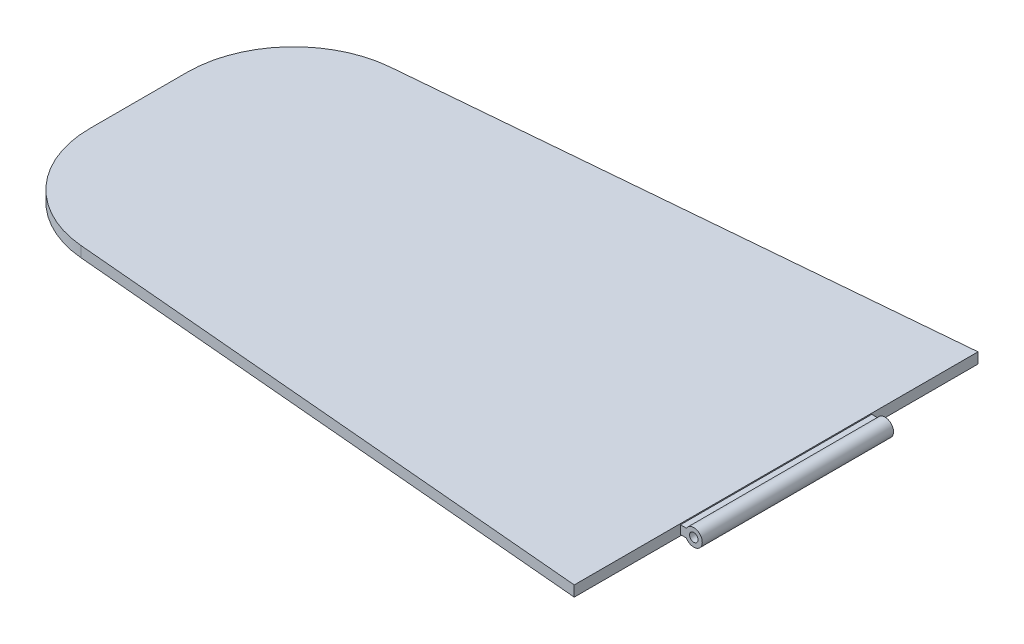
ISO-10303-21;
HEADER;
FILE_DESCRIPTION(('STEP AP214'),'2;1');
FILE_NAME('part.step','',(''),(''),'','','');
FILE_SCHEMA(('AUTOMOTIVE_DESIGN { 1 0 10303 214 1 1 1 1 }'));
ENDSEC;
DATA;
#1=APPLICATION_CONTEXT('core data for automotive mechanical design processes');
#2=APPLICATION_PROTOCOL_DEFINITION('international standard','automotive_design',2000,#1);
#3=PRODUCT_CONTEXT('',#1,'mechanical');
#4=PRODUCT('Part','Part','',(#3));
#5=PRODUCT_RELATED_PRODUCT_CATEGORY('part','',(#4));
#6=PRODUCT_DEFINITION_FORMATION('','',#4);
#7=PRODUCT_DEFINITION_CONTEXT('part definition',#1,'design');
#8=PRODUCT_DEFINITION('design','',#6,#7);
#9=PRODUCT_DEFINITION_SHAPE('','',#8);
#10=(LENGTH_UNIT() NAMED_UNIT(*) SI_UNIT(.MILLI.,.METRE.));
#11=(NAMED_UNIT(*) PLANE_ANGLE_UNIT() SI_UNIT($,.RADIAN.));
#12=(NAMED_UNIT(*) SI_UNIT($,.STERADIAN.) SOLID_ANGLE_UNIT());
#13=UNCERTAINTY_MEASURE_WITH_UNIT(LENGTH_MEASURE(1.E-05),#10,'distance_accuracy_value','');
#14=(GEOMETRIC_REPRESENTATION_CONTEXT(3) GLOBAL_UNCERTAINTY_ASSIGNED_CONTEXT((#13)) GLOBAL_UNIT_ASSIGNED_CONTEXT((#10,
#11,#12)) REPRESENTATION_CONTEXT('',''));
#15=CARTESIAN_POINT('',(0.,0.,0.));
#16=DIRECTION('',(0.,0.,1.));
#17=DIRECTION('',(1.,0.,0.));
#18=AXIS2_PLACEMENT_3D('',#15,#16,#17);
#19=CARTESIAN_POINT('',(0.,10.,-190.));
#20=DIRECTION('',(-1.,0.,0.));
#21=DIRECTION('',(0.,0.,1.));
#22=AXIS2_PLACEMENT_3D('',#19,#20,#21);
#23=PLANE('',#22);
#24=DIRECTION('',(0.,0.,-1.));
#25=VECTOR('',#24,1.);
#26=CARTESIAN_POINT('',(0.,0.,-190.));
#27=LINE('',#26,#25);
#28=CARTESIAN_POINT('',(0.,0.,190.));
#29=VERTEX_POINT('',#28);
#30=CARTESIAN_POINT('',(0.,0.,-190.));
#31=VERTEX_POINT('',#30);
#32=EDGE_CURVE('E153',#29,#31,#27,.T.);
#33=ORIENTED_EDGE('',*,*,#32,.T.);
#34=DIRECTION('',(0.,-1.,0.));
#35=VECTOR('',#34,1.);
#36=CARTESIAN_POINT('',(0.,10.,-190.));
#37=LINE('',#36,#35);
#38=CARTESIAN_POINT('',(0.,10.,-190.));
#39=VERTEX_POINT('',#38);
#40=EDGE_CURVE('E163',#39,#31,#37,.T.);
#41=ORIENTED_EDGE('',*,*,#40,.F.);
#42=DIRECTION('',(0.,0.,-1.));
#43=VECTOR('',#42,1.);
#44=CARTESIAN_POINT('',(0.,10.,-190.));
#45=LINE('',#44,#43);
#46=CARTESIAN_POINT('',(0.,10.,190.));
#47=VERTEX_POINT('',#46);
#48=EDGE_CURVE('E161',#47,#39,#45,.T.);
#49=ORIENTED_EDGE('',*,*,#48,.F.);
#50=DIRECTION('',(0.,-1.,0.));
#51=VECTOR('',#50,1.);
#52=CARTESIAN_POINT('',(0.,10.,190.));
#53=LINE('',#52,#51);
#54=EDGE_CURVE('E177',#47,#29,#53,.T.);
#55=ORIENTED_EDGE('',*,*,#54,.T.);
#56=EDGE_LOOP('',(#33,#41,#49,#55));
#57=FACE_BOUND('',#56,.T.);
#58=DIRECTION('',(0.,0.,-1.));
#59=VECTOR('',#58,1.);
#60=CARTESIAN_POINT('',(0.,0.999999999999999,90.));
#61=LINE('',#60,#59);
#62=CARTESIAN_POINT('',(0.,0.999999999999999,90.));
#63=VERTEX_POINT('',#62);
#64=CARTESIAN_POINT('',(0.,0.999999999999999,-90.));
#65=VERTEX_POINT('',#64);
#66=EDGE_CURVE('E49',#63,#65,#61,.T.);
#67=ORIENTED_EDGE('',*,*,#66,.F.);
#68=DIRECTION('',(0.,-1.,0.));
#69=VECTOR('',#68,1.);
#70=CARTESIAN_POINT('',(0.,9.,90.));
#71=LINE('',#70,#69);
#72=CARTESIAN_POINT('',(0.,9.,90.));
#73=VERTEX_POINT('',#72);
#74=EDGE_CURVE('E117',#73,#63,#71,.T.);
#75=ORIENTED_EDGE('',*,*,#74,.F.);
#76=DIRECTION('',(0.,0.,-1.));
#77=VECTOR('',#76,1.);
#78=CARTESIAN_POINT('',(0.,9.,90.));
#79=LINE('',#78,#77);
#80=CARTESIAN_POINT('',(0.,9.,-90.));
#81=VERTEX_POINT('',#80);
#82=EDGE_CURVE('E133',#73,#81,#79,.T.);
#83=ORIENTED_EDGE('',*,*,#82,.T.);
#84=DIRECTION('',(0.,-1.,0.));
#85=VECTOR('',#84,1.);
#86=CARTESIAN_POINT('',(0.,9.,-90.));
#87=LINE('',#86,#85);
#88=EDGE_CURVE('E54',#81,#65,#87,.T.);
#89=ORIENTED_EDGE('',*,*,#88,.T.);
#90=EDGE_LOOP('',(#67,#75,#83,#89));
#91=FACE_BOUND('',#90,.T.);
#92=ADVANCED_FACE('F34',(#57,#91),#23,.F.);
#93=CARTESIAN_POINT('',(0.,10.,-190.));
#94=DIRECTION('',(0.0871557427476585,0.,0.996194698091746));
#95=DIRECTION('',(0.996194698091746,0.,-0.0871557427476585));
#96=AXIS2_PLACEMENT_3D('',#93,#94,#95);
#97=PLANE('',#96);
#98=DIRECTION('',(-0.996194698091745,0.,0.0871557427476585));
#99=VECTOR('',#98,1.);
#100=CARTESIAN_POINT('',(0.,0.,-190.));
#101=LINE('',#100,#99);
#102=CARTESIAN_POINT('',(-508.715574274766,0.,-145.493154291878));
#103=VERTEX_POINT('',#102);
#104=EDGE_CURVE('E148',#31,#103,#101,.T.);
#105=ORIENTED_EDGE('',*,*,#104,.T.);
#106=DIRECTION('',(0.,-1.,0.));
#107=VECTOR('',#106,1.);
#108=CARTESIAN_POINT('',(-508.715574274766,10.,-145.493154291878));
#109=LINE('',#108,#107);
#110=CARTESIAN_POINT('',(-508.715574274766,10.,-145.493154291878));
#111=VERTEX_POINT('',#110);
#112=EDGE_CURVE('E11',#111,#103,#109,.T.);
#113=ORIENTED_EDGE('',*,*,#112,.F.);
#114=DIRECTION('',(-0.996194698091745,0.,0.0871557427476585));
#115=VECTOR('',#114,1.);
#116=CARTESIAN_POINT('',(0.,10.,-190.));
#117=LINE('',#116,#115);
#118=EDGE_CURVE('E149',#39,#111,#117,.T.);
#119=ORIENTED_EDGE('',*,*,#118,.F.);
#120=ORIENTED_EDGE('',*,*,#40,.T.);
#121=EDGE_LOOP('',(#105,#113,#119,#120));
#122=FACE_BOUND('',#121,.T.);
#123=ADVANCED_FACE('F36',(#122),#97,.F.);
#124=CARTESIAN_POINT('',(-500.,10.,-45.8736844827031));
#125=DIRECTION('',(0.,-1.,0.));
#126=DIRECTION('',(0.,0.,-1.));
#127=AXIS2_PLACEMENT_3D('',#124,#125,#126);
#128=CYLINDRICAL_SURFACE('',#127,99.9999999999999);
#129=CARTESIAN_POINT('',(-500.,0.,-45.8736844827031));
#130=DIRECTION('',(0.,1.,0.));
#131=DIRECTION('',(0.,0.,1.));
#132=AXIS2_PLACEMENT_3D('',#129,#130,#131);
#133=CIRCLE('',#132,99.9999999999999);
#134=CARTESIAN_POINT('',(-600.,0.,-45.8736844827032));
#135=VERTEX_POINT('',#134);
#136=EDGE_CURVE('E166',#103,#135,#133,.T.);
#137=ORIENTED_EDGE('',*,*,#136,.T.);
#138=DIRECTION('',(0.,-1.,0.));
#139=VECTOR('',#138,1.);
#140=CARTESIAN_POINT('',(-600.,10.,-45.8736844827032));
#141=LINE('',#140,#139);
#142=CARTESIAN_POINT('',(-600.,10.,-45.8736844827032));
#143=VERTEX_POINT('',#142);
#144=EDGE_CURVE('E42',#143,#135,#141,.T.);
#145=ORIENTED_EDGE('',*,*,#144,.F.);
#146=CARTESIAN_POINT('',(-500.,10.,-45.8736844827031));
#147=DIRECTION('',(0.,1.,0.));
#148=DIRECTION('',(0.,0.,1.));
#149=AXIS2_PLACEMENT_3D('',#146,#147,#148);
#150=CIRCLE('',#149,99.9999999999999);
#151=EDGE_CURVE('E152',#111,#143,#150,.T.);
#152=ORIENTED_EDGE('',*,*,#151,.F.);
#153=ORIENTED_EDGE('',*,*,#112,.T.);
#154=EDGE_LOOP('',(#137,#145,#152,#153));
#155=FACE_BOUND('',#154,.T.);
#156=ADVANCED_FACE('F213',(#155),#128,.T.);
#157=CARTESIAN_POINT('',(-600.,10.,-45.8736844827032));
#158=DIRECTION('',(1.,0.,0.));
#159=DIRECTION('',(0.,0.,-1.));
#160=AXIS2_PLACEMENT_3D('',#157,#158,#159);
#161=PLANE('',#160);
#162=DIRECTION('',(0.,0.,1.));
#163=VECTOR('',#162,1.);
#164=CARTESIAN_POINT('',(-600.,0.,-45.8736844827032));
#165=LINE('',#164,#163);
#166=CARTESIAN_POINT('',(-600.,0.,45.8736844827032));
#167=VERTEX_POINT('',#166);
#168=EDGE_CURVE('E168',#135,#167,#165,.T.);
#169=ORIENTED_EDGE('',*,*,#168,.T.);
#170=DIRECTION('',(0.,-1.,0.));
#171=VECTOR('',#170,1.);
#172=CARTESIAN_POINT('',(-600.,10.,45.8736844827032));
#173=LINE('',#172,#171);
#174=CARTESIAN_POINT('',(-600.,10.,45.8736844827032));
#175=VERTEX_POINT('',#174);
#176=EDGE_CURVE('E183',#175,#167,#173,.T.);
#177=ORIENTED_EDGE('',*,*,#176,.F.);
#178=DIRECTION('',(0.,0.,1.));
#179=VECTOR('',#178,1.);
#180=CARTESIAN_POINT('',(-600.,10.,-45.8736844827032));
#181=LINE('',#180,#179);
#182=EDGE_CURVE('E155',#143,#175,#181,.T.);
#183=ORIENTED_EDGE('',*,*,#182,.F.);
#184=ORIENTED_EDGE('',*,*,#144,.T.);
#185=EDGE_LOOP('',(#169,#177,#183,#184));
#186=FACE_BOUND('',#185,.T.);
#187=ADVANCED_FACE('F190',(#186),#161,.F.);
#188=CARTESIAN_POINT('',(-500.,10.,45.8736844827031));
#189=DIRECTION('',(0.,-1.,0.));
#190=DIRECTION('',(0.,0.,-1.));
#191=AXIS2_PLACEMENT_3D('',#188,#189,#190);
#192=CYLINDRICAL_SURFACE('',#191,99.9999999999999);
#193=CARTESIAN_POINT('',(-500.,0.,45.8736844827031));
#194=DIRECTION('',(0.,1.,0.));
#195=DIRECTION('',(0.,0.,-1.));
#196=AXIS2_PLACEMENT_3D('',#193,#194,#195);
#197=CIRCLE('',#196,99.9999999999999);
#198=CARTESIAN_POINT('',(-508.715574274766,0.,145.493154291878));
#199=VERTEX_POINT('',#198);
#200=EDGE_CURVE('E170',#167,#199,#197,.T.);
#201=ORIENTED_EDGE('',*,*,#200,.T.);
#202=DIRECTION('',(0.,-1.,0.));
#203=VECTOR('',#202,1.);
#204=CARTESIAN_POINT('',(-508.715574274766,10.,145.493154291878));
#205=LINE('',#204,#203);
#206=CARTESIAN_POINT('',(-508.715574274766,10.,145.493154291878));
#207=VERTEX_POINT('',#206);
#208=EDGE_CURVE('E180',#207,#199,#205,.T.);
#209=ORIENTED_EDGE('',*,*,#208,.F.);
#210=CARTESIAN_POINT('',(-500.,10.,45.8736844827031));
#211=DIRECTION('',(0.,1.,0.));
#212=DIRECTION('',(0.,0.,-1.));
#213=AXIS2_PLACEMENT_3D('',#210,#211,#212);
#214=CIRCLE('',#213,99.9999999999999);
#215=EDGE_CURVE('E157',#175,#207,#214,.T.);
#216=ORIENTED_EDGE('',*,*,#215,.F.);
#217=ORIENTED_EDGE('',*,*,#176,.T.);
#218=EDGE_LOOP('',(#201,#209,#216,#217));
#219=FACE_BOUND('',#218,.T.);
#220=ADVANCED_FACE('F201',(#219),#192,.T.);
#221=CARTESIAN_POINT('',(0.,10.,190.));
#222=DIRECTION('',(0.0871557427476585,0.,-0.996194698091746));
#223=DIRECTION('',(-0.996194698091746,0.,-0.0871557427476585));
#224=AXIS2_PLACEMENT_3D('',#221,#222,#223);
#225=PLANE('',#224);
#226=DIRECTION('',(0.996194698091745,0.,0.0871557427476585));
#227=VECTOR('',#226,1.);
#228=CARTESIAN_POINT('',(0.,0.,190.));
#229=LINE('',#228,#227);
#230=EDGE_CURVE('E172',#199,#29,#229,.T.);
#231=ORIENTED_EDGE('',*,*,#230,.T.);
#232=ORIENTED_EDGE('',*,*,#54,.F.);
#233=DIRECTION('',(0.996194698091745,0.,0.0871557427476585));
#234=VECTOR('',#233,1.);
#235=CARTESIAN_POINT('',(0.,10.,190.));
#236=LINE('',#235,#234);
#237=EDGE_CURVE('E159',#207,#47,#236,.T.);
#238=ORIENTED_EDGE('',*,*,#237,.F.);
#239=ORIENTED_EDGE('',*,*,#208,.T.);
#240=EDGE_LOOP('',(#231,#232,#238,#239));
#241=FACE_BOUND('',#240,.T.);
#242=ADVANCED_FACE('F205',(#241),#225,.F.);
#243=CARTESIAN_POINT('',(-500.,10.,-45.8736844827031));
#244=DIRECTION('',(0.,1.,0.));
#245=DIRECTION('',(0.,0.,1.));
#246=AXIS2_PLACEMENT_3D('',#243,#244,#245);
#247=PLANE('',#246);
#248=ORIENTED_EDGE('',*,*,#118,.T.);
#249=ORIENTED_EDGE('',*,*,#151,.T.);
#250=ORIENTED_EDGE('',*,*,#182,.T.);
#251=ORIENTED_EDGE('',*,*,#215,.T.);
#252=ORIENTED_EDGE('',*,*,#237,.T.);
#253=ORIENTED_EDGE('',*,*,#48,.T.);
#254=EDGE_LOOP('',(#248,#249,#250,#251,#252,#253));
#255=FACE_BOUND('',#254,.T.);
#256=ADVANCED_FACE('F209',(#255),#247,.T.);
#257=CARTESIAN_POINT('',(-500.,0.,-45.8736844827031));
#258=DIRECTION('',(0.,1.,0.));
#259=DIRECTION('',(0.,0.,1.));
#260=AXIS2_PLACEMENT_3D('',#257,#258,#259);
#261=PLANE('',#260);
#262=ORIENTED_EDGE('',*,*,#104,.F.);
#263=ORIENTED_EDGE('',*,*,#32,.F.);
#264=ORIENTED_EDGE('',*,*,#230,.F.);
#265=ORIENTED_EDGE('',*,*,#200,.F.);
#266=ORIENTED_EDGE('',*,*,#168,.F.);
#267=ORIENTED_EDGE('',*,*,#136,.F.);
#268=EDGE_LOOP('',(#262,#263,#264,#265,#266,#267));
#269=FACE_BOUND('',#268,.T.);
#270=ADVANCED_FACE('F196',(#269),#261,.F.);
#271=CARTESIAN_POINT('',(12.5,5.,90.));
#272=DIRECTION('',(0.,0.,1.));
#273=DIRECTION('',(1.,0.,0.));
#274=AXIS2_PLACEMENT_3D('',#271,#272,#273);
#275=PLANE('',#274);
#276=ORIENTED_EDGE('',*,*,#74,.T.);
#277=DIRECTION('',(1.,0.,0.));
#278=VECTOR('',#277,1.);
#279=CARTESIAN_POINT('',(0.,0.999999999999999,90.));
#280=LINE('',#279,#278);
#281=CARTESIAN_POINT('',(5.57179676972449,1.,90.));
#282=VERTEX_POINT('',#281);
#283=EDGE_CURVE('E109',#63,#282,#280,.T.);
#284=ORIENTED_EDGE('',*,*,#283,.T.);
#285=CARTESIAN_POINT('',(12.5,5.,90.));
#286=DIRECTION('',(0.,0.,1.));
#287=DIRECTION('',(1.,0.,0.));
#288=AXIS2_PLACEMENT_3D('',#285,#286,#287);
#289=CIRCLE('',#288,8.);
#290=CARTESIAN_POINT('',(5.57179676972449,9.,90.));
#291=VERTEX_POINT('',#290);
#292=EDGE_CURVE('E115',#282,#291,#289,.T.);
#293=ORIENTED_EDGE('',*,*,#292,.T.);
#294=DIRECTION('',(-1.,0.,0.));
#295=VECTOR('',#294,1.);
#296=CARTESIAN_POINT('',(0.,9.,90.));
#297=LINE('',#296,#295);
#298=EDGE_CURVE('E131',#291,#73,#297,.T.);
#299=ORIENTED_EDGE('',*,*,#298,.T.);
#300=EDGE_LOOP('',(#276,#284,#293,#299));
#301=FACE_BOUND('',#300,.T.);
#302=CARTESIAN_POINT('',(12.5,5.,90.));
#303=DIRECTION('',(0.,0.,1.));
#304=DIRECTION('',(1.,0.,0.));
#305=AXIS2_PLACEMENT_3D('',#302,#303,#304);
#306=CIRCLE('',#305,4.);
#307=CARTESIAN_POINT('',(8.5,5.,90.));
#308=VERTEX_POINT('',#307);
#309=EDGE_CURVE('E138',#308,#308,#306,.T.);
#310=ORIENTED_EDGE('',*,*,#309,.F.);
#311=EDGE_LOOP('',(#310));
#312=FACE_BOUND('',#311,.T.);
#313=ADVANCED_FACE('F111',(#301,#312),#275,.T.);
#314=CARTESIAN_POINT('',(12.5,5.,-90.));
#315=DIRECTION('',(0.,0.,1.));
#316=DIRECTION('',(1.,0.,0.));
#317=AXIS2_PLACEMENT_3D('',#314,#315,#316);
#318=PLANE('',#317);
#319=ORIENTED_EDGE('',*,*,#88,.F.);
#320=DIRECTION('',(-1.,0.,0.));
#321=VECTOR('',#320,1.);
#322=CARTESIAN_POINT('',(0.,9.,-90.));
#323=LINE('',#322,#321);
#324=CARTESIAN_POINT('',(5.57179676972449,9.,-90.));
#325=VERTEX_POINT('',#324);
#326=EDGE_CURVE('E142',#325,#81,#323,.T.);
#327=ORIENTED_EDGE('',*,*,#326,.F.);
#328=CARTESIAN_POINT('',(12.5,5.,-90.));
#329=DIRECTION('',(0.,0.,1.));
#330=DIRECTION('',(1.,0.,0.));
#331=AXIS2_PLACEMENT_3D('',#328,#329,#330);
#332=CIRCLE('',#331,8.);
#333=CARTESIAN_POINT('',(5.57179676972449,1.,-90.));
#334=VERTEX_POINT('',#333);
#335=EDGE_CURVE('E140',#334,#325,#332,.T.);
#336=ORIENTED_EDGE('',*,*,#335,.F.);
#337=DIRECTION('',(1.,0.,0.));
#338=VECTOR('',#337,1.);
#339=CARTESIAN_POINT('',(0.,0.999999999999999,-90.));
#340=LINE('',#339,#338);
#341=EDGE_CURVE('E123',#65,#334,#340,.T.);
#342=ORIENTED_EDGE('',*,*,#341,.F.);
#343=EDGE_LOOP('',(#319,#327,#336,#342));
#344=FACE_BOUND('',#343,.T.);
#345=CARTESIAN_POINT('',(12.5,5.,-90.));
#346=DIRECTION('',(0.,0.,1.));
#347=DIRECTION('',(1.,0.,0.));
#348=AXIS2_PLACEMENT_3D('',#345,#346,#347);
#349=CIRCLE('',#348,4.);
#350=CARTESIAN_POINT('',(8.5,5.,-90.));
#351=VERTEX_POINT('',#350);
#352=EDGE_CURVE('E337',#351,#351,#349,.T.);
#353=ORIENTED_EDGE('',*,*,#352,.T.);
#354=EDGE_LOOP('',(#353));
#355=FACE_BOUND('',#354,.T.);
#356=ADVANCED_FACE('F262',(#344,#355),#318,.F.);
#357=CARTESIAN_POINT('',(0.,0.999999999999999,90.));
#358=DIRECTION('',(0.,1.,0.));
#359=DIRECTION('',(0.,0.,1.));
#360=AXIS2_PLACEMENT_3D('',#357,#358,#359);
#361=PLANE('',#360);
#362=ORIENTED_EDGE('',*,*,#341,.T.);
#363=DIRECTION('',(0.,0.,-1.));
#364=VECTOR('',#363,1.);
#365=CARTESIAN_POINT('',(5.57179676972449,1.,90.));
#366=LINE('',#365,#364);
#367=EDGE_CURVE('E121',#282,#334,#366,.T.);
#368=ORIENTED_EDGE('',*,*,#367,.F.);
#369=ORIENTED_EDGE('',*,*,#283,.F.);
#370=ORIENTED_EDGE('',*,*,#66,.T.);
#371=EDGE_LOOP('',(#362,#368,#369,#370));
#372=FACE_BOUND('',#371,.T.);
#373=ADVANCED_FACE('F122',(#372),#361,.F.);
#374=CARTESIAN_POINT('',(12.5,5.,90.));
#375=DIRECTION('',(0.,0.,-1.));
#376=DIRECTION('',(-1.,0.,0.));
#377=AXIS2_PLACEMENT_3D('',#374,#375,#376);
#378=CYLINDRICAL_SURFACE('',#377,8.);
#379=ORIENTED_EDGE('',*,*,#335,.T.);
#380=DIRECTION('',(0.,0.,-1.));
#381=VECTOR('',#380,1.);
#382=CARTESIAN_POINT('',(5.57179676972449,9.,90.));
#383=LINE('',#382,#381);
#384=EDGE_CURVE('E126',#291,#325,#383,.T.);
#385=ORIENTED_EDGE('',*,*,#384,.F.);
#386=ORIENTED_EDGE('',*,*,#292,.F.);
#387=ORIENTED_EDGE('',*,*,#367,.T.);
#388=EDGE_LOOP('',(#379,#385,#386,#387));
#389=FACE_BOUND('',#388,.T.);
#390=ADVANCED_FACE('F128',(#389),#378,.T.);
#391=CARTESIAN_POINT('',(0.,9.,90.));
#392=DIRECTION('',(0.,-1.,0.));
#393=DIRECTION('',(0.,0.,-1.));
#394=AXIS2_PLACEMENT_3D('',#391,#392,#393);
#395=PLANE('',#394);
#396=ORIENTED_EDGE('',*,*,#326,.T.);
#397=ORIENTED_EDGE('',*,*,#82,.F.);
#398=ORIENTED_EDGE('',*,*,#298,.F.);
#399=ORIENTED_EDGE('',*,*,#384,.T.);
#400=EDGE_LOOP('',(#396,#397,#398,#399));
#401=FACE_BOUND('',#400,.T.);
#402=ADVANCED_FACE('F282',(#401),#395,.F.);
#403=CARTESIAN_POINT('',(12.5,5.,90.));
#404=DIRECTION('',(0.,0.,-1.));
#405=DIRECTION('',(-1.,0.,0.));
#406=AXIS2_PLACEMENT_3D('',#403,#404,#405);
#407=CYLINDRICAL_SURFACE('',#406,4.);
#408=CARTESIAN_POINT('',(8.5,5.,90.));
#409=CARTESIAN_POINT('',(8.5,5.,88.125));
#410=CARTESIAN_POINT('',(8.5,5.,86.25));
#411=CARTESIAN_POINT('',(8.5,5.,82.5));
#412=CARTESIAN_POINT('',(8.5,5.,80.625));
#413=CARTESIAN_POINT('',(8.5,5.,76.875));
#414=CARTESIAN_POINT('',(8.5,5.,75.));
#415=CARTESIAN_POINT('',(8.5,5.,71.25));
#416=CARTESIAN_POINT('',(8.5,5.,69.375));
#417=CARTESIAN_POINT('',(8.5,5.,65.625));
#418=CARTESIAN_POINT('',(8.5,5.,63.75));
#419=CARTESIAN_POINT('',(8.5,5.,60.));
#420=CARTESIAN_POINT('',(8.5,5.,58.125));
#421=CARTESIAN_POINT('',(8.5,5.,54.375));
#422=CARTESIAN_POINT('',(8.5,5.,52.5));
#423=CARTESIAN_POINT('',(8.5,5.,48.75));
#424=CARTESIAN_POINT('',(8.5,5.,46.875));
#425=CARTESIAN_POINT('',(8.5,5.,43.125));
#426=CARTESIAN_POINT('',(8.5,5.,41.25));
#427=CARTESIAN_POINT('',(8.5,5.,37.5));
#428=CARTESIAN_POINT('',(8.5,5.,35.625));
#429=CARTESIAN_POINT('',(8.5,5.,31.875));
#430=CARTESIAN_POINT('',(8.5,5.,30.));
#431=CARTESIAN_POINT('',(8.5,5.,26.25));
#432=CARTESIAN_POINT('',(8.5,5.,24.375));
#433=CARTESIAN_POINT('',(8.5,5.,20.625));
#434=CARTESIAN_POINT('',(8.5,5.,18.75));
#435=CARTESIAN_POINT('',(8.5,5.,15.));
#436=CARTESIAN_POINT('',(8.5,5.,13.125));
#437=CARTESIAN_POINT('',(8.5,5.,9.37499999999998));
#438=CARTESIAN_POINT('',(8.5,5.,7.49999999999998));
#439=CARTESIAN_POINT('',(8.5,5.,3.74999999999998));
#440=CARTESIAN_POINT('',(8.5,5.,1.87499999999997));
#441=CARTESIAN_POINT('',(8.5,5.,-1.87500000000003));
#442=CARTESIAN_POINT('',(8.5,5.,-3.75000000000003));
#443=CARTESIAN_POINT('',(8.5,5.,-7.50000000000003));
#444=CARTESIAN_POINT('',(8.5,5.,-9.37500000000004));
#445=CARTESIAN_POINT('',(8.5,5.,-13.125));
#446=CARTESIAN_POINT('',(8.5,5.,-15.));
#447=CARTESIAN_POINT('',(8.5,5.,-18.75));
#448=CARTESIAN_POINT('',(8.5,5.,-20.625));
#449=CARTESIAN_POINT('',(8.5,5.,-24.375));
#450=CARTESIAN_POINT('',(8.5,5.,-26.25));
#451=CARTESIAN_POINT('',(8.5,5.,-30.));
#452=CARTESIAN_POINT('',(8.5,5.,-31.875));
#453=CARTESIAN_POINT('',(8.5,5.,-35.625));
#454=CARTESIAN_POINT('',(8.5,5.,-37.5));
#455=CARTESIAN_POINT('',(8.5,5.,-41.25));
#456=CARTESIAN_POINT('',(8.5,5.,-43.125));
#457=CARTESIAN_POINT('',(8.5,5.,-46.875));
#458=CARTESIAN_POINT('',(8.5,5.,-48.75));
#459=CARTESIAN_POINT('',(8.5,5.,-52.5));
#460=CARTESIAN_POINT('',(8.5,5.,-54.375));
#461=CARTESIAN_POINT('',(8.5,5.,-58.125));
#462=CARTESIAN_POINT('',(8.5,5.,-60.));
#463=CARTESIAN_POINT('',(8.5,5.,-63.75));
#464=CARTESIAN_POINT('',(8.5,5.,-65.625));
#465=CARTESIAN_POINT('',(8.5,5.,-69.375));
#466=CARTESIAN_POINT('',(8.5,5.,-71.25));
#467=CARTESIAN_POINT('',(8.5,5.,-75.));
#468=CARTESIAN_POINT('',(8.5,5.,-76.875));
#469=CARTESIAN_POINT('',(8.5,5.,-80.625));
#470=CARTESIAN_POINT('',(8.5,5.,-82.5));
#471=CARTESIAN_POINT('',(8.5,5.,-86.25));
#472=CARTESIAN_POINT('',(8.5,5.,-88.125));
#473=CARTESIAN_POINT('',(8.5,5.,-90.));
#474=B_SPLINE_CURVE_WITH_KNOTS('',3,(#408,#409,#410,#411,#412,#413,#414,#415,#416,#417,#418,
#419,#420,#421,#422,#423,#424,#425,#426,#427,#428,#429,#430,#431,#432,#433,#434,#435,#436,#437,
#438,#439,#440,#441,#442,#443,#444,#445,#446,#447,#448,#449,#450,#451,#452,#453,#454,#455,#456,
#457,#458,#459,#460,#461,#462,#463,#464,#465,#466,#467,#468,#469,#470,#471,#472,#473),
.UNSPECIFIED.,.F.,.F.,(4,2,2,2,2,2,2,2,2,2,2,2,2,2,2,2,2,2,2,2,2,2,2,2,2,2,2,2,2,2,2,2,4),(0.,
5.62499999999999,11.25,16.875,22.5,28.125,33.75,39.375,45.,50.625,56.25,61.875,67.5,73.125,
78.75,84.375,90.,95.625,101.25,106.875,112.5,118.125,123.75,129.375,135.,140.625,146.25,151.875,
157.5,163.125,168.75,174.375,180.),.UNSPECIFIED.);
#475=EDGE_CURVE('BSEAM289',#308,#351,#474,.T.);
#476=ORIENTED_EDGE('',*,*,#309,.T.);
#477=ORIENTED_EDGE('',*,*,#352,.F.);
#478=ORIENTED_EDGE('',*,*,#475,.T.);
#479=ORIENTED_EDGE('',*,*,#475,.F.);
#480=EDGE_LOOP('',(#476,#478,#477,#479));
#481=FACE_BOUND('',#480,.T.);
#482=ADVANCED_FACE('F289',(#481),#407,.F.);
#483=CLOSED_SHELL('',(#92,#123,#156,#187,#220,#242,#256,#270,#313,#356,#373,#390,#402,#482));
#484=MANIFOLD_SOLID_BREP('B2',#483);
#485=ADVANCED_BREP_SHAPE_REPRESENTATION('',(#18,#484),#14);
#486=SHAPE_DEFINITION_REPRESENTATION(#9,#485);
ENDSEC;
END-ISO-10303-21;
